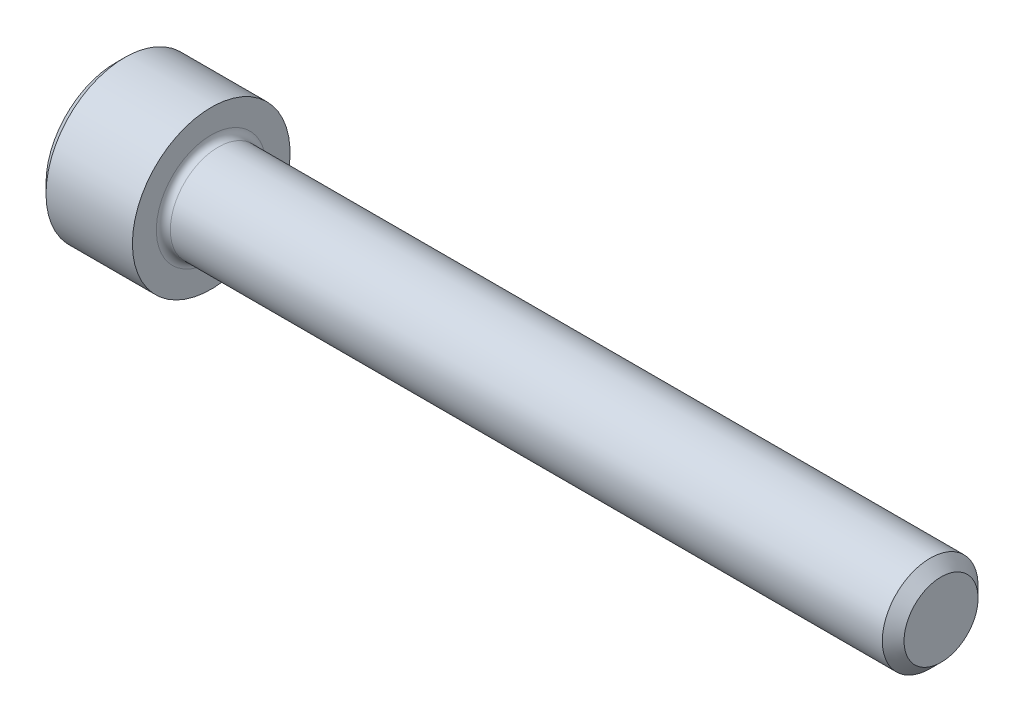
ISO-10303-21;
HEADER;
FILE_DESCRIPTION(('STEP AP214'),'2;1');
FILE_NAME('part.step','',(''),(''),'','','');
FILE_SCHEMA(('AUTOMOTIVE_DESIGN { 1 0 10303 214 1 1 1 1 }'));
ENDSEC;
DATA;
#1=APPLICATION_CONTEXT('core data for automotive mechanical design processes');
#2=APPLICATION_PROTOCOL_DEFINITION('international standard','automotive_design',2000,#1);
#3=PRODUCT_CONTEXT('',#1,'mechanical');
#4=PRODUCT('Part','Part','',(#3));
#5=PRODUCT_RELATED_PRODUCT_CATEGORY('part','',(#4));
#6=PRODUCT_DEFINITION_FORMATION('','',#4);
#7=PRODUCT_DEFINITION_CONTEXT('part definition',#1,'design');
#8=PRODUCT_DEFINITION('design','',#6,#7);
#9=PRODUCT_DEFINITION_SHAPE('','',#8);
#10=(LENGTH_UNIT() NAMED_UNIT(*) SI_UNIT(.MILLI.,.METRE.));
#11=(NAMED_UNIT(*) PLANE_ANGLE_UNIT() SI_UNIT($,.RADIAN.));
#12=(NAMED_UNIT(*) SI_UNIT($,.STERADIAN.) SOLID_ANGLE_UNIT());
#13=UNCERTAINTY_MEASURE_WITH_UNIT(LENGTH_MEASURE(1.E-05),#10,'distance_accuracy_value','');
#14=(GEOMETRIC_REPRESENTATION_CONTEXT(3) GLOBAL_UNCERTAINTY_ASSIGNED_CONTEXT((#13)) GLOBAL_UNIT_ASSIGNED_CONTEXT((#10,
#11,#12)) REPRESENTATION_CONTEXT('',''));
#15=CARTESIAN_POINT('',(0.,0.,0.));
#16=DIRECTION('',(0.,0.,1.));
#17=DIRECTION('',(1.,0.,0.));
#18=AXIS2_PLACEMENT_3D('',#15,#16,#17);
#19=CARTESIAN_POINT('',(0.,0.,0.));
#20=DIRECTION('',(-1.,0.,0.));
#21=DIRECTION('',(0.,0.,1.));
#22=AXIS2_PLACEMENT_3D('',#19,#20,#21);
#23=PLANE('',#22);
#24=DIRECTION('',(0.,-0.499999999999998,0.86602540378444));
#25=VECTOR('',#24,1.);
#26=CARTESIAN_POINT('',(0.,2.05305755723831,0.));
#27=LINE('',#26,#25);
#28=CARTESIAN_POINT('',(0.,2.05305755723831,0.));
#29=VERTEX_POINT('',#28);
#30=CARTESIAN_POINT('',(0.,1.02652877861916,1.778));
#31=VERTEX_POINT('',#30);
#32=EDGE_CURVE('E373',#29,#31,#27,.T.);
#33=ORIENTED_EDGE('',*,*,#32,.T.);
#34=DIRECTION('',(0.,1.,0.));
#35=VECTOR('',#34,1.);
#36=CARTESIAN_POINT('',(0.,-1.02652877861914,1.778));
#37=LINE('',#36,#35);
#38=CARTESIAN_POINT('',(0.,-1.02652877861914,1.778));
#39=VERTEX_POINT('',#38);
#40=EDGE_CURVE('E129',#39,#31,#37,.T.);
#41=ORIENTED_EDGE('',*,*,#40,.F.);
#42=DIRECTION('',(0.,-0.500000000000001,-0.866025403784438));
#43=VECTOR('',#42,1.);
#44=CARTESIAN_POINT('',(0.,-1.02652877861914,1.778));
#45=LINE('',#44,#43);
#46=CARTESIAN_POINT('',(0.,-2.0530575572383,0.));
#47=VERTEX_POINT('',#46);
#48=EDGE_CURVE('E376',#39,#47,#45,.T.);
#49=ORIENTED_EDGE('',*,*,#48,.T.);
#50=DIRECTION('',(0.,0.499999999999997,-0.86602540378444));
#51=VECTOR('',#50,1.);
#52=CARTESIAN_POINT('',(0.,-2.0530575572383,0.));
#53=LINE('',#52,#51);
#54=CARTESIAN_POINT('',(0.,-1.02652877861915,-1.778));
#55=VERTEX_POINT('',#54);
#56=EDGE_CURVE('E379',#47,#55,#53,.T.);
#57=ORIENTED_EDGE('',*,*,#56,.T.);
#58=DIRECTION('',(0.,-1.,0.));
#59=VECTOR('',#58,1.);
#60=CARTESIAN_POINT('',(0.,1.02652877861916,-1.778));
#61=LINE('',#60,#59);
#62=CARTESIAN_POINT('',(0.,1.02652877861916,-1.778));
#63=VERTEX_POINT('',#62);
#64=EDGE_CURVE('E382',#63,#55,#61,.T.);
#65=ORIENTED_EDGE('',*,*,#64,.F.);
#66=DIRECTION('',(0.,-0.500000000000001,-0.866025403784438));
#67=VECTOR('',#66,1.);
#68=CARTESIAN_POINT('',(0.,2.05305755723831,0.));
#69=LINE('',#68,#67);
#70=EDGE_CURVE('E124',#29,#63,#69,.T.);
#71=ORIENTED_EDGE('',*,*,#70,.F.);
#72=EDGE_LOOP('',(#33,#41,#49,#57,#65,#71));
#73=FACE_BOUND('',#72,.T.);
#74=CARTESIAN_POINT('',(0.,0.,0.));
#75=DIRECTION('',(-1.,0.,0.));
#76=DIRECTION('',(0.,0.,1.));
#77=AXIS2_PLACEMENT_3D('',#74,#75,#76);
#78=CIRCLE('',#77,3.0226);
#79=CARTESIAN_POINT('',(0.,0.,3.0226));
#80=VERTEX_POINT('',#79);
#81=EDGE_CURVE('E140',#80,#80,#78,.T.);
#82=ORIENTED_EDGE('',*,*,#81,.T.);
#83=EDGE_LOOP('',(#82));
#84=FACE_BOUND('',#83,.T.);
#85=ADVANCED_FACE('F33',(#73,#84),#23,.T.);
#86=CARTESIAN_POINT('',(35.9156,1.61036,0.));
#87=DIRECTION('',(1.,0.,0.));
#88=DIRECTION('',(0.,0.,-1.));
#89=AXIS2_PLACEMENT_3D('',#86,#87,#88);
#90=PLANE('',#89);
#91=CARTESIAN_POINT('',(35.9156,0.,0.));
#92=DIRECTION('',(-1.,0.,0.));
#93=DIRECTION('',(0.,0.,1.));
#94=AXIS2_PLACEMENT_3D('',#91,#92,#93);
#95=CIRCLE('',#94,1.61036);
#96=CARTESIAN_POINT('',(35.9156,0.,1.61036));
#97=VERTEX_POINT('',#96);
#98=EDGE_CURVE('E153',#97,#97,#95,.T.);
#99=ORIENTED_EDGE('',*,*,#98,.F.);
#100=EDGE_LOOP('',(#99));
#101=FACE_BOUND('',#100,.T.);
#102=ADVANCED_FACE('F174',(#101),#90,.T.);
#103=CARTESIAN_POINT('',(35.9156,0.,0.));
#104=DIRECTION('',(-1.,0.,0.));
#105=DIRECTION('',(0.,0.,1.));
#106=AXIS2_PLACEMENT_3D('',#103,#104,#105);
#107=CONICAL_SURFACE('',#106,1.61036,0.785398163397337);
#108=CARTESIAN_POINT('',(35.44316,0.,0.));
#109=DIRECTION('',(-1.,0.,0.));
#110=DIRECTION('',(0.,0.,1.));
#111=AXIS2_PLACEMENT_3D('',#108,#109,#110);
#112=CIRCLE('',#111,2.08279999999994);
#113=CARTESIAN_POINT('',(35.44316,0.,2.08279999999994));
#114=VERTEX_POINT('',#113);
#115=EDGE_CURVE('E150',#114,#114,#112,.T.);
#116=ORIENTED_EDGE('',*,*,#115,.F.);
#117=EDGE_LOOP('',(#116));
#118=FACE_BOUND('',#117,.T.);
#119=ORIENTED_EDGE('',*,*,#98,.T.);
#120=EDGE_LOOP('',(#119));
#121=FACE_BOUND('',#120,.T.);
#122=ADVANCED_FACE('F180',(#118,#121),#107,.T.);
#123=CARTESIAN_POINT('',(-31.75,0.,0.));
#124=DIRECTION('',(-1.,0.,0.));
#125=DIRECTION('',(0.,0.,1.));
#126=AXIS2_PLACEMENT_3D('',#123,#124,#125);
#127=CYLINDRICAL_SURFACE('',#126,2.08279999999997);
#128=CARTESIAN_POINT('',(4.4704,0.,0.));
#129=DIRECTION('',(1.,0.,0.));
#130=DIRECTION('',(0.,0.,-1.));
#131=AXIS2_PLACEMENT_3D('',#128,#129,#130);
#132=CIRCLE('',#131,2.08279999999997);
#133=CARTESIAN_POINT('',(4.4704,0.,-2.08279999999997));
#134=VERTEX_POINT('',#133);
#135=EDGE_CURVE('E11',#134,#134,#132,.T.);
#136=ORIENTED_EDGE('',*,*,#135,.T.);
#137=EDGE_LOOP('',(#136));
#138=FACE_BOUND('',#137,.T.);
#139=ORIENTED_EDGE('',*,*,#115,.T.);
#140=EDGE_LOOP('',(#139));
#141=FACE_BOUND('',#140,.T.);
#142=ADVANCED_FACE('F191',(#138,#141),#127,.T.);
#143=CARTESIAN_POINT('',(4.1656,3.429,0.));
#144=DIRECTION('',(1.,0.,0.));
#145=DIRECTION('',(0.,0.,-1.));
#146=AXIS2_PLACEMENT_3D('',#143,#144,#145);
#147=PLANE('',#146);
#148=CARTESIAN_POINT('',(4.1656,0.,0.));
#149=DIRECTION('',(1.,0.,0.));
#150=DIRECTION('',(0.,0.,-1.));
#151=AXIS2_PLACEMENT_3D('',#148,#149,#150);
#152=CIRCLE('',#151,2.38759999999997);
#153=CARTESIAN_POINT('',(4.1656,0.,-2.38759999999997));
#154=VERTEX_POINT('',#153);
#155=EDGE_CURVE('E41',#154,#154,#152,.F.);
#156=ORIENTED_EDGE('',*,*,#155,.T.);
#157=EDGE_LOOP('',(#156));
#158=FACE_BOUND('',#157,.T.);
#159=CARTESIAN_POINT('',(4.1656,0.,0.));
#160=DIRECTION('',(-1.,0.,0.));
#161=DIRECTION('',(0.,0.,1.));
#162=AXIS2_PLACEMENT_3D('',#159,#160,#161);
#163=CIRCLE('',#162,3.429);
#164=CARTESIAN_POINT('',(4.1656,0.,3.429));
#165=VERTEX_POINT('',#164);
#166=EDGE_CURVE('E147',#165,#165,#163,.T.);
#167=ORIENTED_EDGE('',*,*,#166,.F.);
#168=EDGE_LOOP('',(#167));
#169=FACE_BOUND('',#168,.T.);
#170=ADVANCED_FACE('F158',(#158,#169),#147,.T.);
#171=CARTESIAN_POINT('',(-31.75,0.,0.));
#172=DIRECTION('',(-1.,0.,0.));
#173=DIRECTION('',(0.,0.,1.));
#174=AXIS2_PLACEMENT_3D('',#171,#172,#173);
#175=CYLINDRICAL_SURFACE('',#174,3.429);
#176=ORIENTED_EDGE('',*,*,#166,.T.);
#177=EDGE_LOOP('',(#176));
#178=FACE_BOUND('',#177,.T.);
#179=CARTESIAN_POINT('',(0.406400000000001,0.,0.));
#180=DIRECTION('',(-1.,0.,0.));
#181=DIRECTION('',(0.,0.,1.));
#182=AXIS2_PLACEMENT_3D('',#179,#180,#181);
#183=CIRCLE('',#182,3.429);
#184=CARTESIAN_POINT('',(0.406400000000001,0.,3.429));
#185=VERTEX_POINT('',#184);
#186=EDGE_CURVE('E144',#185,#185,#183,.T.);
#187=ORIENTED_EDGE('',*,*,#186,.F.);
#188=EDGE_LOOP('',(#187));
#189=FACE_BOUND('',#188,.T.);
#190=ADVANCED_FACE('F169',(#178,#189),#175,.T.);
#191=CARTESIAN_POINT('',(0.,0.,0.));
#192=DIRECTION('',(1.,0.,0.));
#193=DIRECTION('',(0.,0.,-1.));
#194=AXIS2_PLACEMENT_3D('',#191,#192,#193);
#195=CONICAL_SURFACE('',#194,3.0226,0.785398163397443);
#196=ORIENTED_EDGE('',*,*,#186,.T.);
#197=EDGE_LOOP('',(#196));
#198=FACE_BOUND('',#197,.T.);
#199=ORIENTED_EDGE('',*,*,#81,.F.);
#200=EDGE_LOOP('',(#199));
#201=FACE_BOUND('',#200,.T.);
#202=ADVANCED_FACE('F162',(#198,#201),#195,.T.);
#203=CARTESIAN_POINT('',(4.4704,0.,0.));
#204=DIRECTION('',(1.,0.,0.));
#205=DIRECTION('',(0.,0.,-1.));
#206=AXIS2_PLACEMENT_3D('',#203,#204,#205);
#207=TOROIDAL_SURFACE('',#206,2.38759999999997,0.3048);
#208=ORIENTED_EDGE('',*,*,#135,.F.);
#209=EDGE_LOOP('',(#208));
#210=FACE_BOUND('',#209,.T.);
#211=ORIENTED_EDGE('',*,*,#155,.F.);
#212=EDGE_LOOP('',(#211));
#213=FACE_BOUND('',#212,.T.);
#214=ADVANCED_FACE('F35',(#210,#213),#207,.F.);
#215=CARTESIAN_POINT('',(1.9558,2.05305755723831,0.));
#216=DIRECTION('',(0.,-0.86602540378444,-0.499999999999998));
#217=DIRECTION('',(0.,0.499999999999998,-0.86602540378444));
#218=AXIS2_PLACEMENT_3D('',#215,#216,#217);
#219=PLANE('',#218);
#220=ORIENTED_EDGE('',*,*,#32,.F.);
#221=DIRECTION('',(-1.,0.,0.));
#222=VECTOR('',#221,1.);
#223=CARTESIAN_POINT('',(1.9558,2.05305755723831,0.));
#224=LINE('',#223,#222);
#225=CARTESIAN_POINT('',(1.9558,2.05305755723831,0.));
#226=VERTEX_POINT('',#225);
#227=EDGE_CURVE('E363',#226,#29,#224,.T.);
#228=ORIENTED_EDGE('',*,*,#227,.F.);
#229=DIRECTION('',(0.,-0.499999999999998,0.86602540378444));
#230=VECTOR('',#229,1.);
#231=CARTESIAN_POINT('',(1.9558,2.05305755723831,0.));
#232=LINE('',#231,#230);
#233=CARTESIAN_POINT('',(1.9558,1.53979316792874,0.888999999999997));
#234=VERTEX_POINT('',#233);
#235=EDGE_CURVE('E116',#226,#234,#232,.T.);
#236=ORIENTED_EDGE('',*,*,#235,.T.);
#237=CARTESIAN_POINT('',(1.9558,1.02652877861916,1.778));
#238=VERTEX_POINT('',#237);
#239=EDGE_CURVE('E107',#234,#238,#232,.T.);
#240=ORIENTED_EDGE('',*,*,#239,.T.);
#241=DIRECTION('',(-1.,0.,0.));
#242=VECTOR('',#241,1.);
#243=CARTESIAN_POINT('',(1.9558,1.02652877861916,1.778));
#244=LINE('',#243,#242);
#245=EDGE_CURVE('E121',#238,#31,#244,.T.);
#246=ORIENTED_EDGE('',*,*,#245,.T.);
#247=EDGE_LOOP('',(#220,#228,#236,#240,#246));
#248=FACE_BOUND('',#247,.T.);
#249=ADVANCED_FACE('F120',(#248),#219,.T.);
#250=CARTESIAN_POINT('',(1.9558,-1.02652877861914,1.778));
#251=DIRECTION('',(0.,0.,1.));
#252=DIRECTION('',(0.,-1.,0.));
#253=AXIS2_PLACEMENT_3D('',#250,#251,#252);
#254=PLANE('',#253);
#255=ORIENTED_EDGE('',*,*,#40,.T.);
#256=ORIENTED_EDGE('',*,*,#245,.F.);
#257=DIRECTION('',(0.,1.,0.));
#258=VECTOR('',#257,1.);
#259=CARTESIAN_POINT('',(1.9558,-1.02652877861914,1.778));
#260=LINE('',#259,#258);
#261=CARTESIAN_POINT('',(1.9558,0.,1.778));
#262=VERTEX_POINT('',#261);
#263=EDGE_CURVE('E104',#262,#238,#260,.T.);
#264=ORIENTED_EDGE('',*,*,#263,.F.);
#265=CARTESIAN_POINT('',(1.9558,-1.02652877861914,1.778));
#266=VERTEX_POINT('',#265);
#267=EDGE_CURVE('E115',#266,#262,#260,.T.);
#268=ORIENTED_EDGE('',*,*,#267,.F.);
#269=DIRECTION('',(-1.,0.,0.));
#270=VECTOR('',#269,1.);
#271=CARTESIAN_POINT('',(1.9558,-1.02652877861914,1.778));
#272=LINE('',#271,#270);
#273=EDGE_CURVE('E131',#266,#39,#272,.T.);
#274=ORIENTED_EDGE('',*,*,#273,.T.);
#275=EDGE_LOOP('',(#255,#256,#264,#268,#274));
#276=FACE_BOUND('',#275,.T.);
#277=ADVANCED_FACE('F126',(#276),#254,.F.);
#278=CARTESIAN_POINT('',(1.9558,-1.02652877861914,1.778));
#279=DIRECTION('',(0.,0.866025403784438,-0.500000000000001));
#280=DIRECTION('',(0.,0.500000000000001,0.866025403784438));
#281=AXIS2_PLACEMENT_3D('',#278,#279,#280);
#282=PLANE('',#281);
#283=ORIENTED_EDGE('',*,*,#48,.F.);
#284=ORIENTED_EDGE('',*,*,#273,.F.);
#285=DIRECTION('',(0.,-0.500000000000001,-0.866025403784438));
#286=VECTOR('',#285,1.);
#287=CARTESIAN_POINT('',(1.9558,-1.02652877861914,1.778));
#288=LINE('',#287,#286);
#289=CARTESIAN_POINT('',(1.9558,-1.53979316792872,0.888999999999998));
#290=VERTEX_POINT('',#289);
#291=EDGE_CURVE('E402',#266,#290,#288,.T.);
#292=ORIENTED_EDGE('',*,*,#291,.T.);
#293=CARTESIAN_POINT('',(1.9558,-2.0530575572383,0.));
#294=VERTEX_POINT('',#293);
#295=EDGE_CURVE('E391',#290,#294,#288,.T.);
#296=ORIENTED_EDGE('',*,*,#295,.T.);
#297=DIRECTION('',(-1.,0.,0.));
#298=VECTOR('',#297,1.);
#299=CARTESIAN_POINT('',(1.9558,-2.0530575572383,0.));
#300=LINE('',#299,#298);
#301=EDGE_CURVE('E136',#294,#47,#300,.T.);
#302=ORIENTED_EDGE('',*,*,#301,.T.);
#303=EDGE_LOOP('',(#283,#284,#292,#296,#302));
#304=FACE_BOUND('',#303,.T.);
#305=ADVANCED_FACE('F254',(#304),#282,.T.);
#306=CARTESIAN_POINT('',(1.9558,-2.0530575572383,0.));
#307=DIRECTION('',(0.,0.86602540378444,0.499999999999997));
#308=DIRECTION('',(0.,-0.499999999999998,0.86602540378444));
#309=AXIS2_PLACEMENT_3D('',#306,#307,#308);
#310=PLANE('',#309);
#311=ORIENTED_EDGE('',*,*,#56,.F.);
#312=ORIENTED_EDGE('',*,*,#301,.F.);
#313=DIRECTION('',(0.,0.499999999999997,-0.86602540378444));
#314=VECTOR('',#313,1.);
#315=CARTESIAN_POINT('',(1.9558,-2.0530575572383,0.));
#316=LINE('',#315,#314);
#317=CARTESIAN_POINT('',(1.9558,-1.53979316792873,-0.888999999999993));
#318=VERTEX_POINT('',#317);
#319=EDGE_CURVE('E369',#294,#318,#316,.T.);
#320=ORIENTED_EDGE('',*,*,#319,.T.);
#321=CARTESIAN_POINT('',(1.9558,-1.02652877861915,-1.778));
#322=VERTEX_POINT('',#321);
#323=EDGE_CURVE('E401',#318,#322,#316,.T.);
#324=ORIENTED_EDGE('',*,*,#323,.T.);
#325=DIRECTION('',(-1.,0.,0.));
#326=VECTOR('',#325,1.);
#327=CARTESIAN_POINT('',(1.9558,-1.02652877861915,-1.778));
#328=LINE('',#327,#326);
#329=EDGE_CURVE('E362',#322,#55,#328,.T.);
#330=ORIENTED_EDGE('',*,*,#329,.T.);
#331=EDGE_LOOP('',(#311,#312,#320,#324,#330));
#332=FACE_BOUND('',#331,.T.);
#333=ADVANCED_FACE('F262',(#332),#310,.T.);
#334=CARTESIAN_POINT('',(1.9558,1.02652877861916,-1.778));
#335=DIRECTION('',(0.,0.,-1.));
#336=DIRECTION('',(0.,1.,0.));
#337=AXIS2_PLACEMENT_3D('',#334,#335,#336);
#338=PLANE('',#337);
#339=ORIENTED_EDGE('',*,*,#64,.T.);
#340=ORIENTED_EDGE('',*,*,#329,.F.);
#341=DIRECTION('',(0.,-1.,0.));
#342=VECTOR('',#341,1.);
#343=CARTESIAN_POINT('',(1.9558,1.02652877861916,-1.778));
#344=LINE('',#343,#342);
#345=CARTESIAN_POINT('',(1.9558,0.,-1.778));
#346=VERTEX_POINT('',#345);
#347=EDGE_CURVE('E366',#346,#322,#344,.T.);
#348=ORIENTED_EDGE('',*,*,#347,.F.);
#349=CARTESIAN_POINT('',(1.9558,1.02652877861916,-1.778));
#350=VERTEX_POINT('',#349);
#351=EDGE_CURVE('E48',#350,#346,#344,.T.);
#352=ORIENTED_EDGE('',*,*,#351,.F.);
#353=DIRECTION('',(-1.,0.,0.));
#354=VECTOR('',#353,1.);
#355=CARTESIAN_POINT('',(1.9558,1.02652877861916,-1.778));
#356=LINE('',#355,#354);
#357=EDGE_CURVE('E359',#350,#63,#356,.T.);
#358=ORIENTED_EDGE('',*,*,#357,.T.);
#359=EDGE_LOOP('',(#339,#340,#348,#352,#358));
#360=FACE_BOUND('',#359,.T.);
#361=ADVANCED_FACE('F271',(#360),#338,.F.);
#362=CARTESIAN_POINT('',(1.9558,2.05305755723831,0.));
#363=DIRECTION('',(0.,0.866025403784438,-0.500000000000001));
#364=DIRECTION('',(0.,0.500000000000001,0.866025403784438));
#365=AXIS2_PLACEMENT_3D('',#362,#363,#364);
#366=PLANE('',#365);
#367=ORIENTED_EDGE('',*,*,#70,.T.);
#368=ORIENTED_EDGE('',*,*,#357,.F.);
#369=DIRECTION('',(0.,-0.500000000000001,-0.866025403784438));
#370=VECTOR('',#369,1.);
#371=CARTESIAN_POINT('',(1.9558,2.05305755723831,0.));
#372=LINE('',#371,#370);
#373=CARTESIAN_POINT('',(1.9558,1.53979316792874,-0.889000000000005));
#374=VERTEX_POINT('',#373);
#375=EDGE_CURVE('E349',#374,#350,#372,.T.);
#376=ORIENTED_EDGE('',*,*,#375,.F.);
#377=EDGE_CURVE('E355',#226,#374,#372,.T.);
#378=ORIENTED_EDGE('',*,*,#377,.F.);
#379=ORIENTED_EDGE('',*,*,#227,.T.);
#380=EDGE_LOOP('',(#367,#368,#376,#378,#379));
#381=FACE_BOUND('',#380,.T.);
#382=ADVANCED_FACE('F280',(#381),#366,.F.);
#383=CARTESIAN_POINT('',(1.9558,3.07958633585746,-1.77800000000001));
#384=DIRECTION('',(1.,0.,0.));
#385=DIRECTION('',(0.,0.,-1.));
#386=AXIS2_PLACEMENT_3D('',#383,#384,#385);
#387=PLANE('',#386);
#388=ORIENTED_EDGE('',*,*,#347,.T.);
#389=ORIENTED_EDGE('',*,*,#323,.F.);
#390=CARTESIAN_POINT('',(1.9558,0.,0.));
#391=DIRECTION('',(-1.,0.,0.));
#392=DIRECTION('',(0.,0.,1.));
#393=AXIS2_PLACEMENT_3D('',#390,#391,#392);
#394=CIRCLE('',#393,1.778);
#395=EDGE_CURVE('E397',#346,#318,#394,.T.);
#396=ORIENTED_EDGE('',*,*,#395,.F.);
#397=EDGE_LOOP('',(#388,#389,#396));
#398=FACE_BOUND('',#397,.T.);
#399=ADVANCED_FACE('F289',(#398),#387,.F.);
#400=ORIENTED_EDGE('',*,*,#319,.F.);
#401=ORIENTED_EDGE('',*,*,#295,.F.);
#402=EDGE_CURVE('E134',#318,#290,#394,.T.);
#403=ORIENTED_EDGE('',*,*,#402,.F.);
#404=EDGE_LOOP('',(#400,#401,#403));
#405=FACE_BOUND('',#404,.T.);
#406=ADVANCED_FACE('F298',(#405),#387,.F.);
#407=ORIENTED_EDGE('',*,*,#291,.F.);
#408=ORIENTED_EDGE('',*,*,#267,.T.);
#409=EDGE_CURVE('E130',#290,#262,#394,.T.);
#410=ORIENTED_EDGE('',*,*,#409,.F.);
#411=EDGE_LOOP('',(#407,#408,#410));
#412=FACE_BOUND('',#411,.T.);
#413=ADVANCED_FACE('F307',(#412),#387,.F.);
#414=ORIENTED_EDGE('',*,*,#263,.T.);
#415=ORIENTED_EDGE('',*,*,#239,.F.);
#416=EDGE_CURVE('E110',#262,#234,#394,.T.);
#417=ORIENTED_EDGE('',*,*,#416,.F.);
#418=EDGE_LOOP('',(#414,#415,#417));
#419=FACE_BOUND('',#418,.T.);
#420=ADVANCED_FACE('F106',(#419),#387,.F.);
#421=ORIENTED_EDGE('',*,*,#235,.F.);
#422=ORIENTED_EDGE('',*,*,#377,.T.);
#423=EDGE_CURVE('E141',#234,#374,#394,.T.);
#424=ORIENTED_EDGE('',*,*,#423,.F.);
#425=EDGE_LOOP('',(#421,#422,#424));
#426=FACE_BOUND('',#425,.T.);
#427=ADVANCED_FACE('F322',(#426),#387,.F.);
#428=ORIENTED_EDGE('',*,*,#375,.T.);
#429=ORIENTED_EDGE('',*,*,#351,.T.);
#430=EDGE_CURVE('E352',#374,#346,#394,.T.);
#431=ORIENTED_EDGE('',*,*,#430,.F.);
#432=EDGE_LOOP('',(#428,#429,#431));
#433=FACE_BOUND('',#432,.T.);
#434=ADVANCED_FACE('F237',(#433),#387,.F.);
#435=CARTESIAN_POINT('',(1.9558,0.,0.));
#436=DIRECTION('',(-1.,0.,0.));
#437=DIRECTION('',(0.,0.,1.));
#438=AXIS2_PLACEMENT_3D('',#435,#436,#437);
#439=CONICAL_SURFACE('',#438,1.778,1.04719755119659);
#440=CARTESIAN_POINT('',(2.98232877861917,0.,0.));
#441=VERTEX_POINT('',#440);
#442=VERTEX_LOOP('',#441);
#443=FACE_BOUND('',#442,.T.);
#444=ORIENTED_EDGE('',*,*,#416,.T.);
#445=ORIENTED_EDGE('',*,*,#423,.T.);
#446=ORIENTED_EDGE('',*,*,#430,.T.);
#447=ORIENTED_EDGE('',*,*,#395,.T.);
#448=ORIENTED_EDGE('',*,*,#402,.T.);
#449=ORIENTED_EDGE('',*,*,#409,.T.);
#450=EDGE_LOOP('',(#444,#445,#446,#447,#448,#449));
#451=FACE_BOUND('',#450,.T.);
#452=ADVANCED_FACE('F184',(#443,#451),#439,.F.);
#453=CLOSED_SHELL('',(#85,#102,#122,#142,#170,#190,#202,#214,#249,#277,#305,#333,#361,#382,#399,
#406,#413,#420,#427,#434,#452));
#454=MANIFOLD_SOLID_BREP('B2',#453);
#455=ADVANCED_BREP_SHAPE_REPRESENTATION('',(#18,#454),#14);
#456=SHAPE_DEFINITION_REPRESENTATION(#9,#455);
ENDSEC;
END-ISO-10303-21;
